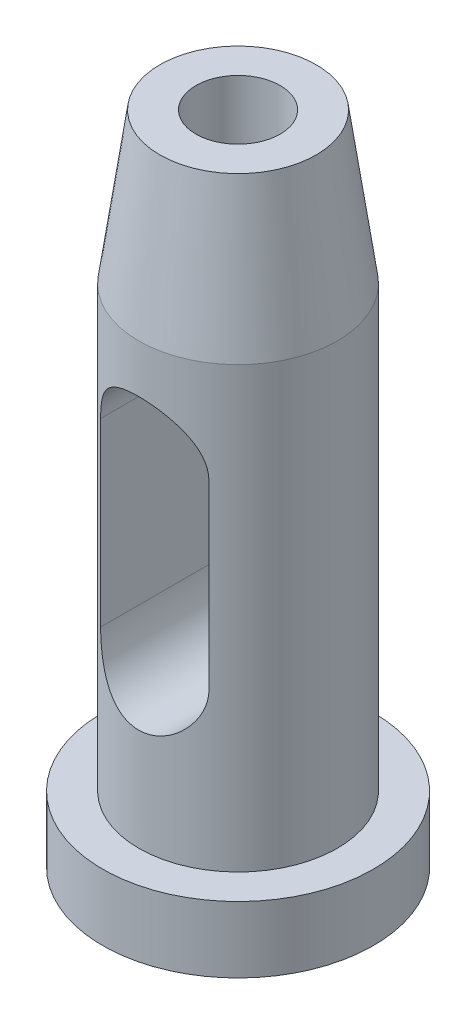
from build123d import *

# Parameters (mm, degrees)
SKETCH1_R                        = 22.5
BOSS_EXTRUDE1_DEPTH              = 84
CUT_EXTRUDE1_START               = -73
SKETCH2_R                        = 22.5
SKETCH2_R_2                      = 16.5
CUT_EXTRUDE1_DEPTH               = 73
CUT_EXTRUDE2_DEPTH               = 49
SKETCH4_R                        = 16.5
BOSS_EXTRUDE2_DEPTH              = 25
BOSS_EXTRUDE2_TAPER              = 8
TAP_DRILL_FOR_M16X2_0_TAP1_D     = 14
TAP_DRILL_FOR_M16X2_0_TAP1_DEPTH = 25
TAP_DRILL_FOR_M16X2_0_TAP1_TIP   = 4.206024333


with BuildPart() as part:
    # Sketch1 → Boss-Extrude1 (new body)
    with BuildSketch(Plane(origin=(0, 0, 0), x_dir=(1, 0, 0), z_dir=(0, 1, 0))):
        with Locations(Location((0, 0, 0), (0, 0, 90))):
            Circle(SKETCH1_R)
    extrude(amount=BOSS_EXTRUDE1_DEPTH)

    # Sketch2 → Cut-Extrude1 (cut)
    with BuildSketch(Plane(origin=(0, 84, 0), x_dir=(1, 0, 0), z_dir=(0, 1, 0)).offset(CUT_EXTRUDE1_START)):
        with Locations(Location((0, 0, 0), (0, 0, 90))):
            Circle(SKETCH2_R)
        with Locations(Location((0, 0, 0), (0, 0, 270))):
            Circle(SKETCH2_R_2, mode=Mode.SUBTRACT)
    extrude(amount=CUT_EXTRUDE1_DEPTH, mode=Mode.SUBTRACT)

    # Sketch3 → Cut-Extrude2 (cut, symmetric)
    with BuildSketch(Plane.XY):
        with BuildLine():
            Line((-9, 37), (-9, 67))
            ThreePointArc((-9, 67), (0, 76), (9, 67))
            Line((9, 67), (9, 37))
            ThreePointArc((9, 37), (0, 28), (-9, 37))
        make_face()
    extrude(amount=CUT_EXTRUDE2_DEPTH, both=True, mode=Mode.SUBTRACT)

    # Sketch4 → Boss-Extrude2 (add)
    with BuildSketch(Plane(origin=(0, 84, 0), x_dir=(1, 0, 0), z_dir=(0, 1, 0))):
        with Locations(Location((0, 0, 0), (0, 0, 270))):
            Circle(SKETCH4_R)
    extrude(amount=BOSS_EXTRUDE2_DEPTH, taper=BOSS_EXTRUDE2_TAPER)

    # Tap Drill for M16x2.0 Tap1
    with Locations(Plane(origin=(0, 109, 0), x_dir=(1, 0, 0), z_dir=(0, 1, 0))):
        with Locations((0, 0)):
            Hole(TAP_DRILL_FOR_M16X2_0_TAP1_D / 2, depth=TAP_DRILL_FOR_M16X2_0_TAP1_DEPTH)
            with Locations((0, 0, -(TAP_DRILL_FOR_M16X2_0_TAP1_DEPTH + TAP_DRILL_FOR_M16X2_0_TAP1_TIP / 2))):  # 118° drill point
                Cone(0, TAP_DRILL_FOR_M16X2_0_TAP1_D / 2, TAP_DRILL_FOR_M16X2_0_TAP1_TIP, mode=Mode.SUBTRACT)


solid = part.part
